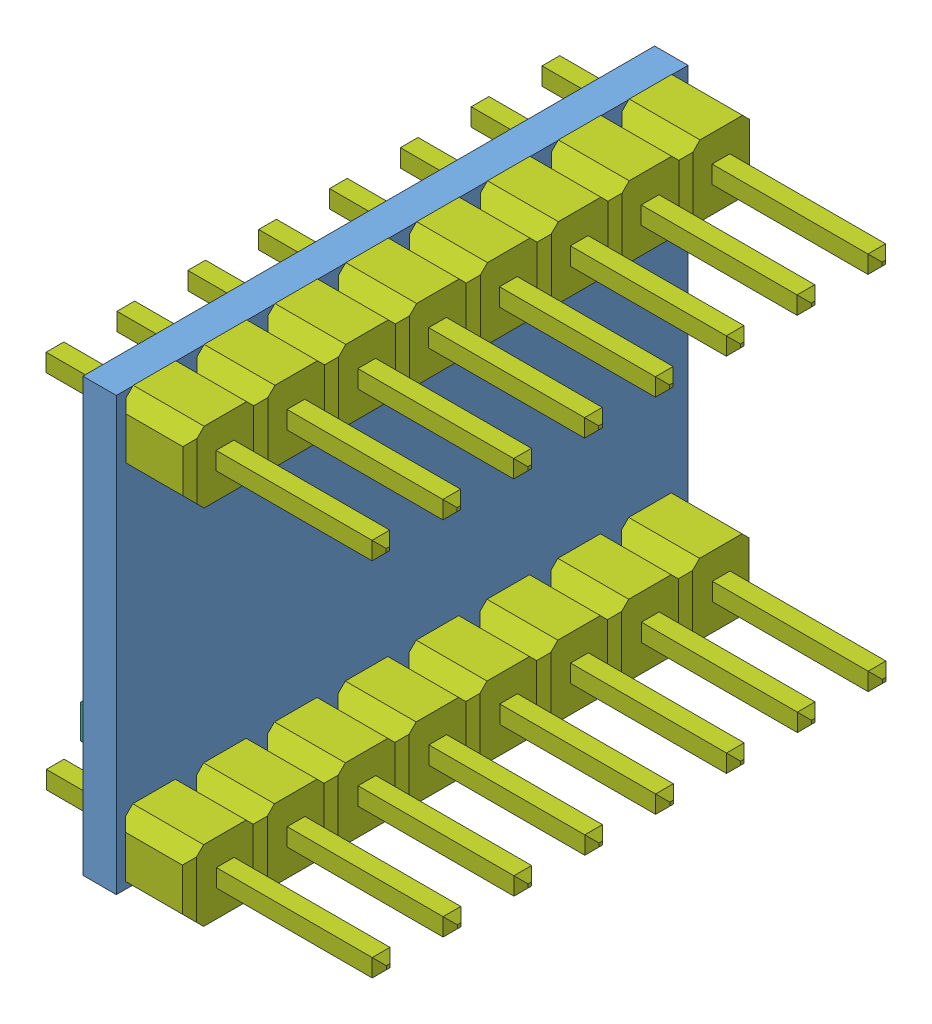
SolidWorks assembly Driver.SLDASM, configuration Predeterminado (file format 6000). Lengths in mm.
Overall size (14.48 15.52 20.5).
10 component instances, 7 part files, 19 mates.
Components (placement in the parent):
- PCBD-1: PCBD.SLDPRT [Predeterminado] at (-3.06 7.7961 30.75) size (1.2 15.5 20.5)
- capt-1: capt.SLDASM [Predeterminado] at (-3.9196 -1.5015 9.55) x (0 1 0) z (0 0 1) size (4.15 4.9 4.15)
  - base-1: base.SLDPRT [Predeterminado] at (-2.2024 -0.8597 2) size (4 1.1 4)
  - cap-1: cap.SLDPRT [Predeterminado] at (-0.2024 -0.0597 4) x (0.986175 0 -0.165705) z (0.165705 0 0.986175) size (3.6 4.1 3.6)
- User Library-SOIC14-150-1-1: User Library-SOIC14-150-1.SLDPRT [Default] at (-3.06 -0.0371 23.1243) x (0 0 1) z (-1 0 0) size (8.53 5.8 1.75)
- 0404_r_1620019-1: 0404_r_1620019.sldprt [Default] at (-3.06 3.0061 13.425) x (0 1 0) z (-1 0 0) size (1.08 1.55 0.45)
- User Library-SC70-5-1-1: User Library-SC70-5-1.SLDPRT [Default] at (-3.01 -3.769 28.9847) x (0 0 1) z (-1 0 0) size (2 2.1 0.95)
- 0404_r_1620019-2: 0404_r_1620019.sldprt [Default] at (-3.06 3.0211 28.76) x (0 0 1) z (-1 0 0) size (1.08 1.55 0.45)
- pin8-3: pin8.SLDPRT [Default] at (-1.86 -6.4456 29.3987) x (0 0 -1) z (0 -1 0) size (20.32 12.19 2.54)
- pin8-4: pin8.SLDPRT [Default] at (-1.86 6.5378 11.6013) x (0 0 1) z (0 1 0) size (20.32 12.19 2.54)
Mates (geometry in assembly coordinates):
- Coincidente1: coincident anti-aligned: plane of PCBD-1 through (-3.06 7.7961 30.75) normal (-1 0 0); plane of capt-1/base-1 through (-3.06 -3.7039 11.55) normal (1 0 0)
- Coincidente5: coincident anti-aligned: plane of PCBD-1 through (-3.06 7.7961 30.75) normal (-1 0 0); plane of User Library-SOIC14-150-1-1 through (-3.06 2.1129 21.3993) normal (1 0 0)
- Distancia1: distance = 4 mm: plane of capt-1/base-1 through (-4.16 -3.7039 11.55) normal (0 -1 0); line of PCBD-1 through (-3.06 -7.7039 30.75) axis (0 0 -1)
- Distancia2: distance = 1.3 mm: plane of capt-1/base-1 through (-4.16 -3.7039 11.55) normal (0 0 -1); line of PCBD-1 through (-3.06 -7.7039 10.25) axis (0 1 0)
- Distancia3: distance = 6 mm: line of PCBD-1 through (-3.06 7.7961 10.25) axis (0 0 1); plane of User Library-SOIC14-150-1-1 through (-3.41 1.7999 28.0243) normal (0.104528 0.994522 0)
- Distancia4: distance = 4.1 mm: plane of User Library-SOIC14-150-1-1 through (-4.01 -2.9371 26.7543) normal (0.173648 0 0.984808); line of PCBD-1 through (-3.06 7.7961 30.75) axis (0 -1 0)
- Coincidente16: coincident anti-aligned: plane of PCBD-1 through (-3.06 7.7961 30.75) normal (-1 0 0); plane of User Library-SC70-5-1-1 through (-3.06 -3.144 29.9847) normal (1 0 0)
- Coincidente17: coincident anti-aligned: plane of PCBD-1 through (-3.06 7.7961 30.75) normal (-1 0 0); plane of 0404_r_1620019-1 through (-3.06 2.4661 14.2) normal (1 0 0)
- Coincidente18: coincident anti-aligned: plane of PCBD-1 through (-3.06 7.7961 30.75) normal (-1 0 0); plane of 0404_r_1620019-2 through (-3.06 2.2461 28.22) normal (1 0 0)
- Distancia5: distance = 1.5 mm: plane of 0404_r_1620019-2 through (-3.06 2.6461 29.25) normal (0 0 1); line of PCBD-1 through (-3.06 7.7961 30.75) axis (0 -1 0)
- Distancia6: distance = 4 mm: plane of 0404_r_1620019-2 through (-3.51 3.7961 29.3) normal (0 1 0); line of PCBD-1 through (-3.06 7.7961 10.25) axis (0 0 1)
- Distancia7: distance = 4.3 mm: plane of 0404_r_1620019-1 through (-3.06 3.4961 13.8) normal (0 1 0); line of PCBD-1 through (-3.06 7.7961 10.25) axis (0 0 1)
- Distancia8: distance = 2.4 mm: line of PCBD-1 through (-3.06 -7.7039 10.25) axis (0 1 0); plane of 0404_r_1620019-1 through (-3.51 3.5461 12.65) normal (0 0 -1)
- Coincidente19: coincident: plane of PCBD-1 through (-3.06 -6.1154 11.9245) normal (0 -1 0); plane of pin8-3 through (-5.67 -6.1154 11.9235) normal (0 1 0)
- Coincidente20: coincident: plane of PCBD-1 through (-1.86 7.7961 30.75) normal (1 0 0); plane of pin8-3 through (-1.86 -7.7156 12.8887) normal (-1 0 0)
- Coincidente21: coincident anti-aligned: plane of PCBD-1 through (-3.06 -6.1154 11.2885) normal (0 0 1); plane of pin8-3 through (-5.67 -6.1154 11.2885) normal (0 0 -1)
- Coincidente22: coincident: plane of PCBD-1 through (-3.06 6.2076 29.7115) normal (0 0 -1); plane of pin8-4 through (-5.67 6.2076 29.7115) normal (0 0 1)
- Coincidente23: coincident: plane of PCBD-1 through (-1.86 7.7961 30.75) normal (1 0 0); plane of pin8-4 through (-1.86 7.8078 28.1113) normal (-1 0 0)
- Coincidente24: coincident anti-aligned: plane of PCBD-1 through (-3.06 6.2076 29.0755) normal (0 1 0); plane of pin8-4 through (-5.67 6.2076 29.0765) normal (0 -1 0)
